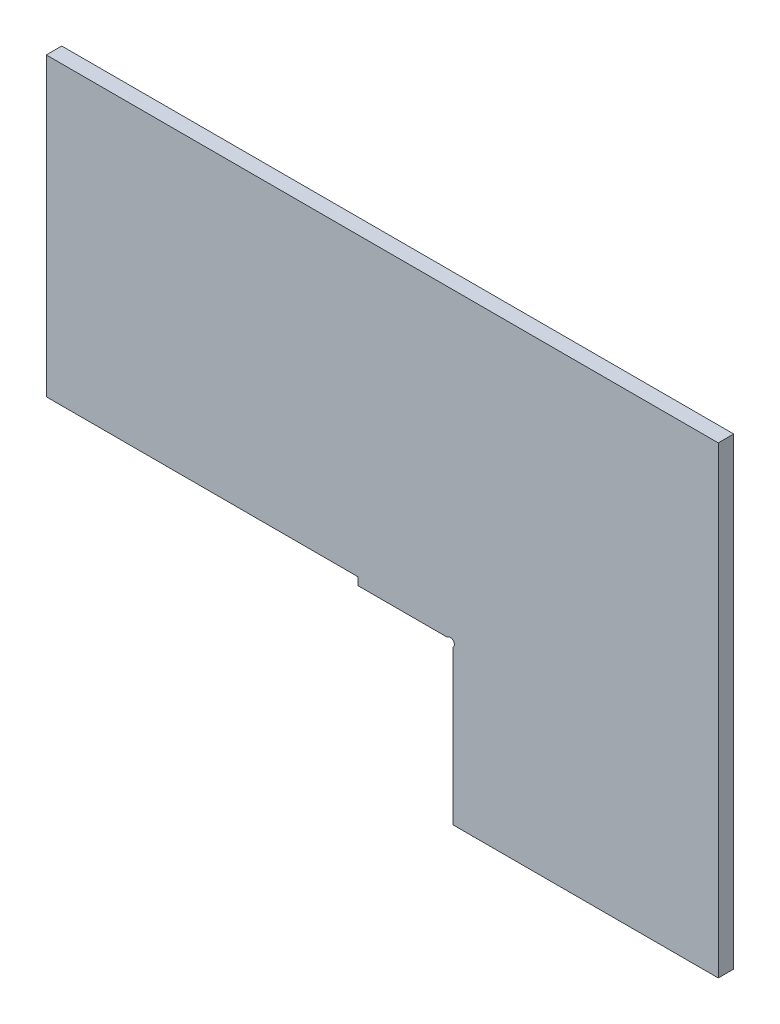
ISO-10303-21;
HEADER;
FILE_DESCRIPTION(('STEP AP214'),'2;1');
FILE_NAME('part.step','',(''),(''),'','','');
FILE_SCHEMA(('AUTOMOTIVE_DESIGN { 1 0 10303 214 1 1 1 1 }'));
ENDSEC;
DATA;
#1=APPLICATION_CONTEXT('core data for automotive mechanical design processes');
#2=APPLICATION_PROTOCOL_DEFINITION('international standard','automotive_design',2000,#1);
#3=PRODUCT_CONTEXT('',#1,'mechanical');
#4=PRODUCT('Part','Part','',(#3));
#5=PRODUCT_RELATED_PRODUCT_CATEGORY('part','',(#4));
#6=PRODUCT_DEFINITION_FORMATION('','',#4);
#7=PRODUCT_DEFINITION_CONTEXT('part definition',#1,'design');
#8=PRODUCT_DEFINITION('design','',#6,#7);
#9=PRODUCT_DEFINITION_SHAPE('','',#8);
#10=(LENGTH_UNIT() NAMED_UNIT(*) SI_UNIT(.MILLI.,.METRE.));
#11=(NAMED_UNIT(*) PLANE_ANGLE_UNIT() SI_UNIT($,.RADIAN.));
#12=(NAMED_UNIT(*) SI_UNIT($,.STERADIAN.) SOLID_ANGLE_UNIT());
#13=UNCERTAINTY_MEASURE_WITH_UNIT(LENGTH_MEASURE(1.E-05),#10,'distance_accuracy_value','');
#14=(GEOMETRIC_REPRESENTATION_CONTEXT(3) GLOBAL_UNCERTAINTY_ASSIGNED_CONTEXT((#13)) GLOBAL_UNIT_ASSIGNED_CONTEXT((#10,
#11,#12)) REPRESENTATION_CONTEXT('',''));
#15=CARTESIAN_POINT('',(0.,0.,0.));
#16=DIRECTION('',(0.,0.,1.));
#17=DIRECTION('',(1.,0.,0.));
#18=AXIS2_PLACEMENT_3D('',#15,#16,#17);
#19=CARTESIAN_POINT('',(-58.4404560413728,12.9128114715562,6.));
#20=DIRECTION('',(1.,0.,0.));
#21=DIRECTION('',(0.,0.,-1.));
#22=AXIS2_PLACEMENT_3D('',#19,#20,#21);
#23=PLANE('',#22);
#24=DIRECTION('',(0.,-1.,0.));
#25=VECTOR('',#24,1.);
#26=CARTESIAN_POINT('',(-58.4404560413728,12.9128114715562,0.));
#27=LINE('',#26,#25);
#28=CARTESIAN_POINT('',(-58.4404560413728,127.912811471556,0.));
#29=VERTEX_POINT('',#28);
#30=CARTESIAN_POINT('',(-58.4404560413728,12.9128114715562,0.));
#31=VERTEX_POINT('',#30);
#32=EDGE_CURVE('E151',#29,#31,#27,.T.);
#33=ORIENTED_EDGE('',*,*,#32,.T.);
#34=DIRECTION('',(0.,0.,-1.));
#35=VECTOR('',#34,1.);
#36=CARTESIAN_POINT('',(-58.4404560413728,12.9128114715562,6.));
#37=LINE('',#36,#35);
#38=CARTESIAN_POINT('',(-58.4404560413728,12.9128114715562,6.));
#39=VERTEX_POINT('',#38);
#40=EDGE_CURVE('E39',#39,#31,#37,.T.);
#41=ORIENTED_EDGE('',*,*,#40,.F.);
#42=DIRECTION('',(0.,-1.,0.));
#43=VECTOR('',#42,1.);
#44=CARTESIAN_POINT('',(-58.4404560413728,12.9128114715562,6.));
#45=LINE('',#44,#43);
#46=CARTESIAN_POINT('',(-58.4404560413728,127.912811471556,6.));
#47=VERTEX_POINT('',#46);
#48=EDGE_CURVE('E126',#47,#39,#45,.T.);
#49=ORIENTED_EDGE('',*,*,#48,.F.);
#50=DIRECTION('',(0.,0.,-1.));
#51=VECTOR('',#50,1.);
#52=CARTESIAN_POINT('',(-58.4404560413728,127.912811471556,6.));
#53=LINE('',#52,#51);
#54=EDGE_CURVE('E133',#47,#29,#53,.T.);
#55=ORIENTED_EDGE('',*,*,#54,.T.);
#56=EDGE_LOOP('',(#33,#41,#49,#55));
#57=FACE_BOUND('',#56,.T.);
#58=ADVANCED_FACE('F32',(#57),#23,.F.);
#59=CARTESIAN_POINT('',(99.5595439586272,12.9128114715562,6.));
#60=DIRECTION('',(0.,1.,0.));
#61=DIRECTION('',(-1.,0.,0.));
#62=AXIS2_PLACEMENT_3D('',#59,#60,#61);
#63=PLANE('',#62);
#64=DIRECTION('',(1.,0.,0.));
#65=VECTOR('',#64,1.);
#66=CARTESIAN_POINT('',(99.5595439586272,12.9128114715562,0.));
#67=LINE('',#66,#65);
#68=CARTESIAN_POINT('',(62.5595439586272,12.9128114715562,0.));
#69=VERTEX_POINT('',#68);
#70=EDGE_CURVE('E146',#31,#69,#67,.T.);
#71=ORIENTED_EDGE('',*,*,#70,.T.);
#72=DIRECTION('',(0.,0.,1.));
#73=VECTOR('',#72,1.);
#74=CARTESIAN_POINT('',(62.5595439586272,12.9128114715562,0.));
#75=LINE('',#74,#73);
#76=CARTESIAN_POINT('',(62.5595439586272,12.9128114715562,6.));
#77=VERTEX_POINT('',#76);
#78=EDGE_CURVE('E53',#69,#77,#75,.T.);
#79=ORIENTED_EDGE('',*,*,#78,.T.);
#80=DIRECTION('',(1.,0.,0.));
#81=VECTOR('',#80,1.);
#82=CARTESIAN_POINT('',(99.5595439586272,12.9128114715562,6.));
#83=LINE('',#82,#81);
#84=EDGE_CURVE('E122',#39,#77,#83,.T.);
#85=ORIENTED_EDGE('',*,*,#84,.F.);
#86=ORIENTED_EDGE('',*,*,#40,.T.);
#87=EDGE_LOOP('',(#71,#79,#85,#86));
#88=FACE_BOUND('',#87,.T.);
#89=ADVANCED_FACE('F145',(#88),#63,.F.);
#90=CARTESIAN_POINT('',(99.5595439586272,-52.0871885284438,6.));
#91=DIRECTION('',(1.,0.,0.));
#92=DIRECTION('',(0.,0.,-1.));
#93=AXIS2_PLACEMENT_3D('',#90,#91,#92);
#94=PLANE('',#93);
#95=DIRECTION('',(0.,-1.,0.));
#96=VECTOR('',#95,1.);
#97=CARTESIAN_POINT('',(99.5595439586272,-52.0871885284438,6.));
#98=LINE('',#97,#96);
#99=CARTESIAN_POINT('',(99.5595439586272,7.65091646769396,6.));
#100=VERTEX_POINT('',#99);
#101=CARTESIAN_POINT('',(99.5595439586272,-52.0871885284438,6.));
#102=VERTEX_POINT('',#101);
#103=EDGE_CURVE('E111',#100,#102,#98,.T.);
#104=ORIENTED_EDGE('',*,*,#103,.F.);
#105=DIRECTION('',(0.,0.,1.));
#106=VECTOR('',#105,1.);
#107=CARTESIAN_POINT('',(99.5595439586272,7.65091646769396,0.));
#108=LINE('',#107,#106);
#109=CARTESIAN_POINT('',(99.5595439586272,7.65091646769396,0.));
#110=VERTEX_POINT('',#109);
#111=EDGE_CURVE('E99',#100,#110,#108,.F.);
#112=ORIENTED_EDGE('',*,*,#111,.T.);
#113=DIRECTION('',(0.,-1.,0.));
#114=VECTOR('',#113,1.);
#115=CARTESIAN_POINT('',(99.5595439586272,-52.0871885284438,0.));
#116=LINE('',#115,#114);
#117=CARTESIAN_POINT('',(99.5595439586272,-52.0871885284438,0.));
#118=VERTEX_POINT('',#117);
#119=EDGE_CURVE('E157',#110,#118,#116,.T.);
#120=ORIENTED_EDGE('',*,*,#119,.T.);
#121=DIRECTION('',(0.,0.,-1.));
#122=VECTOR('',#121,1.);
#123=CARTESIAN_POINT('',(99.5595439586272,-52.0871885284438,6.));
#124=LINE('',#123,#122);
#125=EDGE_CURVE('E119',#102,#118,#124,.T.);
#126=ORIENTED_EDGE('',*,*,#125,.F.);
#127=EDGE_LOOP('',(#104,#112,#120,#126));
#128=FACE_BOUND('',#127,.T.);
#129=ADVANCED_FACE('F117',(#128),#94,.F.);
#130=CARTESIAN_POINT('',(202.559543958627,-52.0871885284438,6.));
#131=DIRECTION('',(0.,1.,0.));
#132=DIRECTION('',(-1.,0.,0.));
#133=AXIS2_PLACEMENT_3D('',#130,#131,#132);
#134=PLANE('',#133);
#135=DIRECTION('',(1.,0.,0.));
#136=VECTOR('',#135,1.);
#137=CARTESIAN_POINT('',(202.559543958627,-52.0871885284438,0.));
#138=LINE('',#137,#136);
#139=CARTESIAN_POINT('',(202.559543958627,-52.0871885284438,0.));
#140=VERTEX_POINT('',#139);
#141=EDGE_CURVE('E163',#118,#140,#138,.T.);
#142=ORIENTED_EDGE('',*,*,#141,.T.);
#143=DIRECTION('',(0.,0.,-1.));
#144=VECTOR('',#143,1.);
#145=CARTESIAN_POINT('',(202.559543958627,-52.0871885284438,6.));
#146=LINE('',#145,#144);
#147=CARTESIAN_POINT('',(202.559543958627,-52.0871885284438,6.));
#148=VERTEX_POINT('',#147);
#149=EDGE_CURVE('E139',#148,#140,#146,.T.);
#150=ORIENTED_EDGE('',*,*,#149,.F.);
#151=DIRECTION('',(1.,0.,0.));
#152=VECTOR('',#151,1.);
#153=CARTESIAN_POINT('',(202.559543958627,-52.0871885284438,6.));
#154=LINE('',#153,#152);
#155=EDGE_CURVE('E121',#102,#148,#154,.T.);
#156=ORIENTED_EDGE('',*,*,#155,.F.);
#157=ORIENTED_EDGE('',*,*,#125,.T.);
#158=EDGE_LOOP('',(#142,#150,#156,#157));
#159=FACE_BOUND('',#158,.T.);
#160=ADVANCED_FACE('F181',(#159),#134,.F.);
#161=CARTESIAN_POINT('',(202.559543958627,127.912811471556,6.));
#162=DIRECTION('',(-1.,0.,0.));
#163=DIRECTION('',(0.,-1.,0.));
#164=AXIS2_PLACEMENT_3D('',#161,#162,#163);
#165=PLANE('',#164);
#166=DIRECTION('',(0.,1.,0.));
#167=VECTOR('',#166,1.);
#168=CARTESIAN_POINT('',(202.559543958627,127.912811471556,0.));
#169=LINE('',#168,#167);
#170=CARTESIAN_POINT('',(202.559543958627,127.912811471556,0.));
#171=VERTEX_POINT('',#170);
#172=EDGE_CURVE('E165',#140,#171,#169,.T.);
#173=ORIENTED_EDGE('',*,*,#172,.T.);
#174=DIRECTION('',(0.,0.,-1.));
#175=VECTOR('',#174,1.);
#176=CARTESIAN_POINT('',(202.559543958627,127.912811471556,6.));
#177=LINE('',#176,#175);
#178=CARTESIAN_POINT('',(202.559543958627,127.912811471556,6.));
#179=VERTEX_POINT('',#178);
#180=EDGE_CURVE('E136',#179,#171,#177,.T.);
#181=ORIENTED_EDGE('',*,*,#180,.F.);
#182=DIRECTION('',(0.,1.,0.));
#183=VECTOR('',#182,1.);
#184=CARTESIAN_POINT('',(202.559543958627,127.912811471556,6.));
#185=LINE('',#184,#183);
#186=EDGE_CURVE('E124',#148,#179,#185,.T.);
#187=ORIENTED_EDGE('',*,*,#186,.F.);
#188=ORIENTED_EDGE('',*,*,#149,.T.);
#189=EDGE_LOOP('',(#173,#181,#187,#188));
#190=FACE_BOUND('',#189,.T.);
#191=ADVANCED_FACE('F178',(#190),#165,.F.);
#192=CARTESIAN_POINT('',(-58.4404560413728,127.912811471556,6.));
#193=DIRECTION('',(0.,-1.,0.));
#194=DIRECTION('',(0.,0.,-1.));
#195=AXIS2_PLACEMENT_3D('',#192,#193,#194);
#196=PLANE('',#195);
#197=DIRECTION('',(-1.,0.,0.));
#198=VECTOR('',#197,1.);
#199=CARTESIAN_POINT('',(-58.4404560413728,127.912811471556,0.));
#200=LINE('',#199,#198);
#201=EDGE_CURVE('E167',#171,#29,#200,.T.);
#202=ORIENTED_EDGE('',*,*,#201,.T.);
#203=ORIENTED_EDGE('',*,*,#54,.F.);
#204=DIRECTION('',(-1.,0.,0.));
#205=VECTOR('',#204,1.);
#206=CARTESIAN_POINT('',(-58.4404560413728,127.912811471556,6.));
#207=LINE('',#206,#205);
#208=EDGE_CURVE('E131',#179,#47,#207,.T.);
#209=ORIENTED_EDGE('',*,*,#208,.F.);
#210=ORIENTED_EDGE('',*,*,#180,.T.);
#211=EDGE_LOOP('',(#202,#203,#209,#210));
#212=FACE_BOUND('',#211,.T.);
#213=ADVANCED_FACE('F173',(#212),#196,.F.);
#214=CARTESIAN_POINT('',(-58.4404560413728,127.912811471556,6.));
#215=DIRECTION('',(0.,0.,-1.));
#216=DIRECTION('',(-1.,0.,0.));
#217=AXIS2_PLACEMENT_3D('',#214,#215,#216);
#218=PLANE('',#217);
#219=DIRECTION('',(1.,0.,0.));
#220=VECTOR('',#219,1.);
#221=CARTESIAN_POINT('',(99.5595439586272,9.91281147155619,6.));
#222=LINE('',#221,#220);
#223=CARTESIAN_POINT('',(62.5595439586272,9.91281147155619,6.));
#224=VERTEX_POINT('',#223);
#225=CARTESIAN_POINT('',(97.297648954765,9.91281147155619,6.));
#226=VERTEX_POINT('',#225);
#227=EDGE_CURVE('E115',#224,#226,#222,.T.);
#228=ORIENTED_EDGE('',*,*,#227,.T.);
#229=CARTESIAN_POINT('',(98.4595439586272,8.81281147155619,6.));
#230=DIRECTION('',(0.,0.,1.));
#231=DIRECTION('',(1.,0.,0.));
#232=AXIS2_PLACEMENT_3D('',#229,#230,#231);
#233=CIRCLE('',#232,1.6);
#234=EDGE_CURVE('E45',#100,#226,#233,.T.);
#235=ORIENTED_EDGE('',*,*,#234,.F.);
#236=ORIENTED_EDGE('',*,*,#103,.T.);
#237=ORIENTED_EDGE('',*,*,#155,.T.);
#238=ORIENTED_EDGE('',*,*,#186,.T.);
#239=ORIENTED_EDGE('',*,*,#208,.T.);
#240=ORIENTED_EDGE('',*,*,#48,.T.);
#241=ORIENTED_EDGE('',*,*,#84,.T.);
#242=DIRECTION('',(0.,-1.,0.));
#243=VECTOR('',#242,1.);
#244=CARTESIAN_POINT('',(62.5595439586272,12.9128114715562,6.));
#245=LINE('',#244,#243);
#246=EDGE_CURVE('E106',#77,#224,#245,.T.);
#247=ORIENTED_EDGE('',*,*,#246,.T.);
#248=EDGE_LOOP('',(#228,#235,#236,#237,#238,#239,#240,#241,#247));
#249=FACE_BOUND('',#248,.T.);
#250=ADVANCED_FACE('F110',(#249),#218,.F.);
#251=CARTESIAN_POINT('',(-58.4404560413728,127.912811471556,0.));
#252=DIRECTION('',(0.,0.,-1.));
#253=DIRECTION('',(-1.,0.,0.));
#254=AXIS2_PLACEMENT_3D('',#251,#252,#253);
#255=PLANE('',#254);
#256=CARTESIAN_POINT('',(98.4595439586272,8.81281147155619,0.));
#257=DIRECTION('',(0.,0.,1.));
#258=DIRECTION('',(1.,0.,0.));
#259=AXIS2_PLACEMENT_3D('',#256,#257,#258);
#260=CIRCLE('',#259,1.6);
#261=CARTESIAN_POINT('',(97.297648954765,9.91281147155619,0.));
#262=VERTEX_POINT('',#261);
#263=EDGE_CURVE('E102',#110,#262,#260,.T.);
#264=ORIENTED_EDGE('',*,*,#263,.T.);
#265=DIRECTION('',(1.,0.,0.));
#266=VECTOR('',#265,1.);
#267=CARTESIAN_POINT('',(99.5595439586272,9.91281147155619,0.));
#268=LINE('',#267,#266);
#269=CARTESIAN_POINT('',(62.5595439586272,9.91281147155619,0.));
#270=VERTEX_POINT('',#269);
#271=EDGE_CURVE('E284',#270,#262,#268,.T.);
#272=ORIENTED_EDGE('',*,*,#271,.F.);
#273=DIRECTION('',(0.,-1.,0.));
#274=VECTOR('',#273,1.);
#275=CARTESIAN_POINT('',(62.5595439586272,12.9128114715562,0.));
#276=LINE('',#275,#274);
#277=EDGE_CURVE('E279',#69,#270,#276,.T.);
#278=ORIENTED_EDGE('',*,*,#277,.F.);
#279=ORIENTED_EDGE('',*,*,#70,.F.);
#280=ORIENTED_EDGE('',*,*,#32,.F.);
#281=ORIENTED_EDGE('',*,*,#201,.F.);
#282=ORIENTED_EDGE('',*,*,#172,.F.);
#283=ORIENTED_EDGE('',*,*,#141,.F.);
#284=ORIENTED_EDGE('',*,*,#119,.F.);
#285=EDGE_LOOP('',(#264,#272,#278,#279,#280,#281,#282,#283,#284));
#286=FACE_BOUND('',#285,.T.);
#287=ADVANCED_FACE('F175',(#286),#255,.T.);
#288=CARTESIAN_POINT('',(99.5595439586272,9.91281147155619,0.));
#289=DIRECTION('',(0.,-1.,0.));
#290=DIRECTION('',(1.,0.,0.));
#291=AXIS2_PLACEMENT_3D('',#288,#289,#290);
#292=PLANE('',#291);
#293=DIRECTION('',(0.,0.,1.));
#294=VECTOR('',#293,1.);
#295=CARTESIAN_POINT('',(97.297648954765,9.91281147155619,0.));
#296=LINE('',#295,#294);
#297=EDGE_CURVE('E11',#226,#262,#296,.F.);
#298=ORIENTED_EDGE('',*,*,#297,.F.);
#299=ORIENTED_EDGE('',*,*,#227,.F.);
#300=DIRECTION('',(0.,0.,1.));
#301=VECTOR('',#300,1.);
#302=CARTESIAN_POINT('',(62.5595439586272,9.91281147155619,0.));
#303=LINE('',#302,#301);
#304=EDGE_CURVE('E155',#270,#224,#303,.T.);
#305=ORIENTED_EDGE('',*,*,#304,.F.);
#306=ORIENTED_EDGE('',*,*,#271,.T.);
#307=EDGE_LOOP('',(#298,#299,#305,#306));
#308=FACE_BOUND('',#307,.T.);
#309=ADVANCED_FACE('F227',(#308),#292,.T.);
#310=CARTESIAN_POINT('',(62.5595439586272,12.9128114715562,0.));
#311=DIRECTION('',(-1.,0.,0.));
#312=DIRECTION('',(0.,0.,1.));
#313=AXIS2_PLACEMENT_3D('',#310,#311,#312);
#314=PLANE('',#313);
#315=ORIENTED_EDGE('',*,*,#246,.F.);
#316=ORIENTED_EDGE('',*,*,#78,.F.);
#317=ORIENTED_EDGE('',*,*,#277,.T.);
#318=ORIENTED_EDGE('',*,*,#304,.T.);
#319=EDGE_LOOP('',(#315,#316,#317,#318));
#320=FACE_BOUND('',#319,.T.);
#321=ADVANCED_FACE('F208',(#320),#314,.T.);
#322=CARTESIAN_POINT('',(98.4595439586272,8.81281147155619,0.));
#323=DIRECTION('',(0.,0.,1.));
#324=DIRECTION('',(1.,0.,0.));
#325=AXIS2_PLACEMENT_3D('',#322,#323,#324);
#326=CYLINDRICAL_SURFACE('',#325,1.6);
#327=ORIENTED_EDGE('',*,*,#234,.T.);
#328=ORIENTED_EDGE('',*,*,#297,.T.);
#329=ORIENTED_EDGE('',*,*,#263,.F.);
#330=ORIENTED_EDGE('',*,*,#111,.F.);
#331=EDGE_LOOP('',(#327,#328,#329,#330));
#332=FACE_BOUND('',#331,.T.);
#333=ADVANCED_FACE('F100',(#332),#326,.F.);
#334=CLOSED_SHELL('',(#58,#89,#129,#160,#191,#213,#250,#287,#309,#321,#333));
#335=MANIFOLD_SOLID_BREP('B2',#334);
#336=ADVANCED_BREP_SHAPE_REPRESENTATION('',(#18,#335),#14);
#337=SHAPE_DEFINITION_REPRESENTATION(#9,#336);
ENDSEC;
END-ISO-10303-21;
